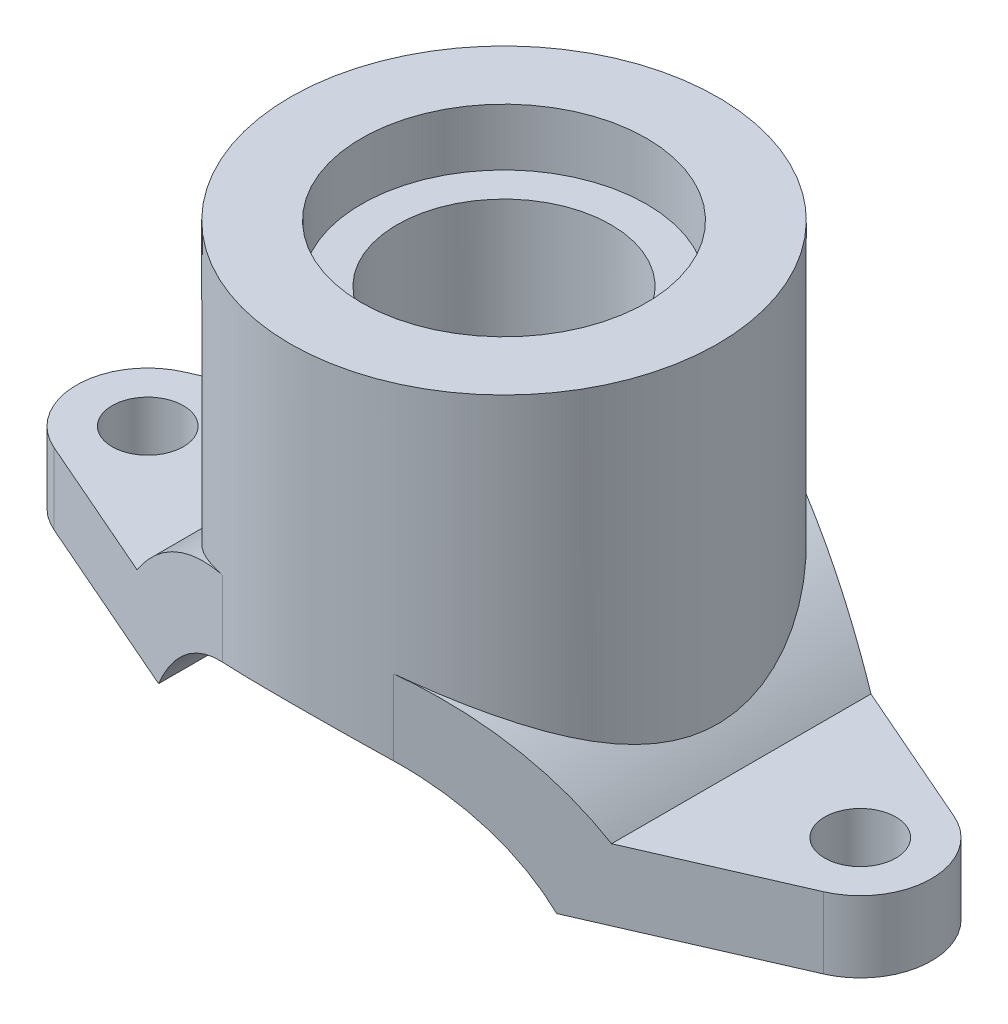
from build123d import *

# Parameters (mm, degrees)
BOSS_EXTRUDE1_DEPTH = 75
SKETCH3_OUTSIDE_W   = 370.368
SKETCH3_OUTSIDE_H   = 220.368
CUT_EXTRUDE1_DEPTH  = 223.162102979
BOSS_EXTRUDE2_REACH = 227
SKETCH4_R           = 75
SKETCH6_R           = 12.5
CUT_EXTRUDE2_DEPTH  = 210.165006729


with BuildPart() as part:
    # Sketch1 → Boss-Extrude1 (new, symmetric)
    with BuildSketch(Plane.XY):
        with BuildLine():
            Line((83.240615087, 25), (150, 25))
            Line((150, 25), (150, 0))
            Line((150, 0), (69.84983894, 0))
            ThreePointArc((69.84983894, 0), (0, 41), (-69.84983894, 0))
            Line((-69.84983894, 0), (-150, 0))
            Line((-150, 0), (-150, 25))
            Line((-150, 25), (-83.240615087, 25))
            ThreePointArc((-83.240615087, 25), (0, 66), (83.240615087, 25))
        make_face()
    extrude(amount=BOSS_EXTRUDE1_DEPTH, both=True)

    # Sketch3 outside → Cut-Extrude1 (cut, through all)
    with BuildSketch(Plane(origin=(0, 66, 75), x_dir=(-1, 0, 0), z_dir=(0, 1, 0))):
        with Locations((0, -75)):
            Rectangle(SKETCH3_OUTSIDE_W, SKETCH3_OUTSIDE_H)
        with BuildLine():
            Line((-30, -6.261364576), (-135, -52.087121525))
            ThreePointArc((-135, -52.087121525), (-150, -75), (-135, -97.912878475))
            Line((-135, -97.912878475), (-30, -143.738635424))
            ThreePointArc((-30, -143.738635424), (0, -150), (30, -143.738635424))
            Line((30, -143.738635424), (135, -97.912878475))
            ThreePointArc((135, -97.912878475), (150, -75), (135, -52.087121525))
            Line((135, -52.087121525), (30, -6.261364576))
            ThreePointArc((30, -6.261364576), (0, 0), (-30, -6.261364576))
        make_face(mode=Mode.SUBTRACT)
    extrude(amount=-CUT_EXTRUDE1_DEPTH, mode=Mode.SUBTRACT)

    # Sketch4 → Boss-Extrude2 (add, up to next)
    with BuildSketch(Plane(origin=(0, 150, 0), x_dir=(-1, 0, 0), z_dir=(0, 1, 0)), mode=Mode.PRIVATE) as boss_extrude2_sk1:
        with Locations(Location((0, 0, 0), (0, 0, 293.578178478))):
            Circle(SKETCH4_R)
    boss_extrude2_tool1 = extrude(boss_extrude2_sk1.sketch, amount=-BOSS_EXTRUDE2_REACH, mode=Mode.PRIVATE) - part.part
    add(boss_extrude2_tool1.solids().sort_by_distance((0, 150, 0))[0])

    # Sketch5 → Cut-Revolve1 (revolve, cut)
    with BuildSketch(Plane.XY, mode=Mode.PRIVATE) as cut_revolve1_sk:
        Polygon((0, 150), (50, 150), (50, 130), (37.5, 130), (37.5, 20), (0, 20), align=None)
    revolve(cut_revolve1_sk.sketch.rotate(Axis((0, 20, 0), (0, 1, 0)), 90), axis=Axis((0, 20, 0), (0, 1, 0)), mode=Mode.SUBTRACT)

    # Sketch6 → Cut-Extrude2 (cut, through all)
    with BuildSketch(Plane(origin=(0, 25, 0), x_dir=(1, 0, 0), z_dir=(0, 1, 0))):
        with Locations(Location((125, 0, 0), (0, 0, 270))):
            Circle(SKETCH6_R)
        with Locations(Location((-125, 0, 0), (0, 0, 270))):
            Circle(SKETCH6_R)
    extrude(amount=-CUT_EXTRUDE2_DEPTH, mode=Mode.SUBTRACT)


solid = part.part
